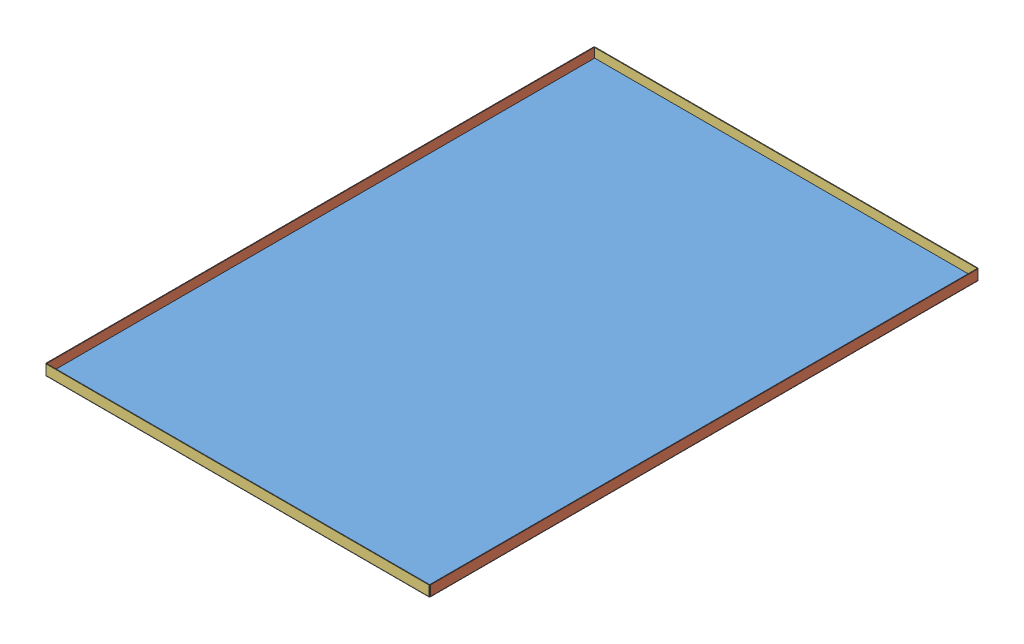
SolidWorks assembly PLATEAU SUPERIEUR.SLDASM, configuration Défaut (file format 4700). Lengths in mm.
Overall size (700 20 1000).
6 component instances, 3 part files, 3 mates.
Components (placement in the parent):
- FOND-1: FOND.SLDPRT [Défaut] at (-206.1908 10.4104 -209.7571) x (0 0 1) z (0 -1 0) size (997 697 2)
- CADRE DE RETENU SUPERIEUR-1: CADRE DE RETENU SUPERIEUR.SLDASM [Défaut] at (-881.4419 8.3924 289.0429) size (700 20 1000)
  - CORNIERE 20x30 1000mm-1: CORNIERE 20x30 1000mm.SLDPRT [Défaut] at (-23.5489 -1.1819 -500) size (30 20 997.6)
  - CORNIERE 20x30 1000mm-2: CORNIERE 20x30 1000mm.SLDPRT [Défaut] at (676.4511 -1.1819 500) x (-1 0 0) z (0 0 -1) size (30 20 997.6)
  - CORNIERE 20x30 700mm-1: CORNIERE 20x30 700mm.SLDPRT [Défaut] at (676.4511 -1.1819 -500) x (0 0 1) z (-1 0 0) size (30 20 697.6)
  - CORNIERE 20x30 700mm-2: CORNIERE 20x30 700mm.SLDPRT [Défaut] at (-23.5489 -1.1819 500) x (0 0 -1) z (1 0 0) size (30 20 697.6)
Mates (geometry in assembly coordinates):
- Coïncidente1: coincident anti-aligned: plane of FOND-1 through (-903.1908 8.4104 -209.7571) normal (0 -1 0); plane of CADRE DE RETENU SUPERIEUR-1/CORNIERE 20x30 1000mm-1 through (-904.9908 8.4104 789.0429) normal (0 1 0)
- Coïncidente2: coincident anti-aligned: plane of FOND-1 through (-206.1908 8.4104 -209.7571) normal (0 0 -1); plane of CADRE DE RETENU SUPERIEUR-1/CORNIERE 20x30 700mm-1 through (-904.9908 27.2104 -209.7571) normal (0 0 1)
- Coïncidente3: coincident anti-aligned: plane of FOND-1 through (-206.1908 8.4104 -209.7571) normal (1 0 0); plane of CADRE DE RETENU SUPERIEUR-1/CORNIERE 20x30 1000mm-2 through (-206.1908 27.2104 -210.9571) normal (-1 0 0)
